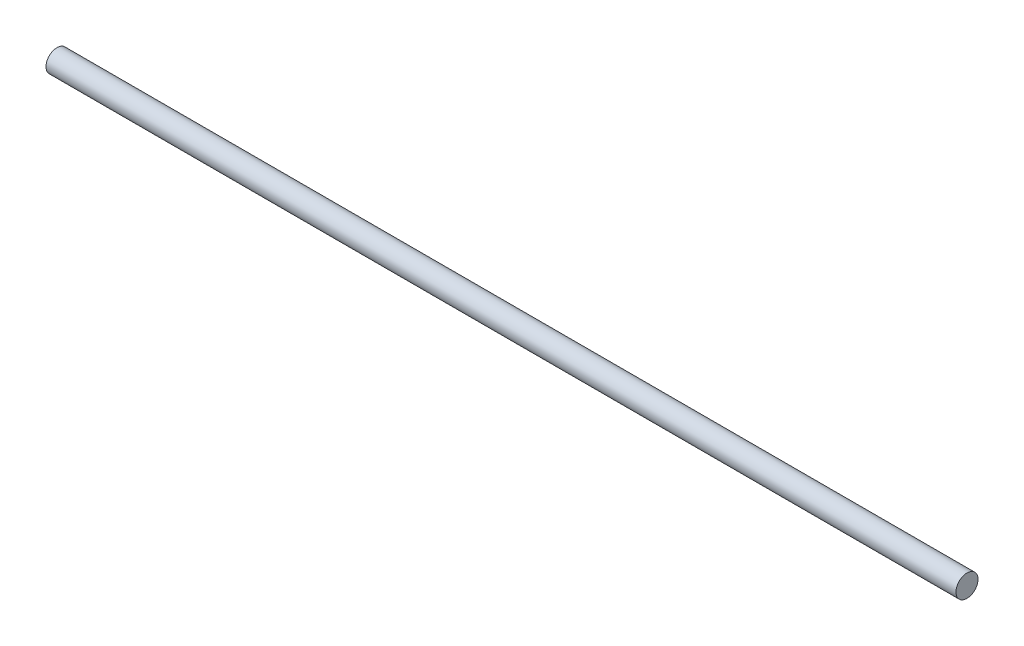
ISO-10303-21;
HEADER;
FILE_DESCRIPTION(('STEP AP214'),'2;1');
FILE_NAME('part.step','',(''),(''),'','','');
FILE_SCHEMA(('AUTOMOTIVE_DESIGN { 1 0 10303 214 1 1 1 1 }'));
ENDSEC;
DATA;
#1=APPLICATION_CONTEXT('core data for automotive mechanical design processes');
#2=APPLICATION_PROTOCOL_DEFINITION('international standard','automotive_design',2000,#1);
#3=PRODUCT_CONTEXT('',#1,'mechanical');
#4=PRODUCT('Part','Part','',(#3));
#5=PRODUCT_RELATED_PRODUCT_CATEGORY('part','',(#4));
#6=PRODUCT_DEFINITION_FORMATION('','',#4);
#7=PRODUCT_DEFINITION_CONTEXT('part definition',#1,'design');
#8=PRODUCT_DEFINITION('design','',#6,#7);
#9=PRODUCT_DEFINITION_SHAPE('','',#8);
#10=(LENGTH_UNIT() NAMED_UNIT(*) SI_UNIT(.MILLI.,.METRE.));
#11=(NAMED_UNIT(*) PLANE_ANGLE_UNIT() SI_UNIT($,.RADIAN.));
#12=(NAMED_UNIT(*) SI_UNIT($,.STERADIAN.) SOLID_ANGLE_UNIT());
#13=UNCERTAINTY_MEASURE_WITH_UNIT(LENGTH_MEASURE(1.E-05),#10,'distance_accuracy_value','');
#14=(GEOMETRIC_REPRESENTATION_CONTEXT(3) GLOBAL_UNCERTAINTY_ASSIGNED_CONTEXT((#13)) GLOBAL_UNIT_ASSIGNED_CONTEXT((#10,
#11,#12)) REPRESENTATION_CONTEXT('',''));
#15=CARTESIAN_POINT('',(0.,0.,0.));
#16=DIRECTION('',(0.,0.,1.));
#17=DIRECTION('',(1.,0.,0.));
#18=AXIS2_PLACEMENT_3D('',#15,#16,#17);
#19=CARTESIAN_POINT('',(0.,5.07999999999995,0.));
#20=DIRECTION('',(1.,0.,0.));
#21=DIRECTION('',(0.,1.,0.));
#22=AXIS2_PLACEMENT_3D('',#19,#20,#21);
#23=PLANE('',#22);
#24=CARTESIAN_POINT('',(0.,0.,0.));
#25=DIRECTION('',(1.,0.,0.));
#26=DIRECTION('',(0.,1.,0.));
#27=AXIS2_PLACEMENT_3D('',#24,#25,#26);
#28=CIRCLE('',#27,5.07999999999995);
#29=CARTESIAN_POINT('',(0.,5.07999999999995,0.));
#30=VERTEX_POINT('',#29);
#31=EDGE_CURVE('E37',#30,#30,#28,.T.);
#32=ORIENTED_EDGE('',*,*,#31,.T.);
#33=EDGE_LOOP('',(#32));
#34=FACE_BOUND('',#33,.T.);
#35=ADVANCED_FACE('F31',(#34),#23,.T.);
#36=CARTESIAN_POINT('',(-419.1,0.,0.));
#37=DIRECTION('',(-1.,0.,0.));
#38=DIRECTION('',(0.,-1.,0.));
#39=AXIS2_PLACEMENT_3D('',#36,#37,#38);
#40=PLANE('',#39);
#41=CARTESIAN_POINT('',(-419.1,0.,0.));
#42=DIRECTION('',(1.,0.,0.));
#43=DIRECTION('',(0.,1.,0.));
#44=AXIS2_PLACEMENT_3D('',#41,#42,#43);
#45=CIRCLE('',#44,5.08);
#46=CARTESIAN_POINT('',(-419.1,5.07999999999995,0.));
#47=VERTEX_POINT('',#46);
#48=EDGE_CURVE('E10',#47,#47,#45,.T.);
#49=ORIENTED_EDGE('',*,*,#48,.F.);
#50=EDGE_LOOP('',(#49));
#51=FACE_BOUND('',#50,.T.);
#52=ADVANCED_FACE('F46',(#51),#40,.T.);
#53=CARTESIAN_POINT('',(0.,0.,0.));
#54=DIRECTION('',(1.,0.,0.));
#55=DIRECTION('',(0.,1.,0.));
#56=AXIS2_PLACEMENT_3D('',#53,#54,#55);
#57=CYLINDRICAL_SURFACE('',#56,5.07999999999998);
#58=ORIENTED_EDGE('',*,*,#48,.T.);
#59=EDGE_LOOP('',(#58));
#60=FACE_BOUND('',#59,.T.);
#61=ORIENTED_EDGE('',*,*,#31,.F.);
#62=EDGE_LOOP('',(#61));
#63=FACE_BOUND('',#62,.T.);
#64=ADVANCED_FACE('F44',(#60,#63),#57,.T.);
#65=CLOSED_SHELL('',(#35,#52,#64));
#66=MANIFOLD_SOLID_BREP('B2',#65);
#67=ADVANCED_BREP_SHAPE_REPRESENTATION('',(#18,#66),#14);
#68=SHAPE_DEFINITION_REPRESENTATION(#9,#67);
ENDSEC;
END-ISO-10303-21;
